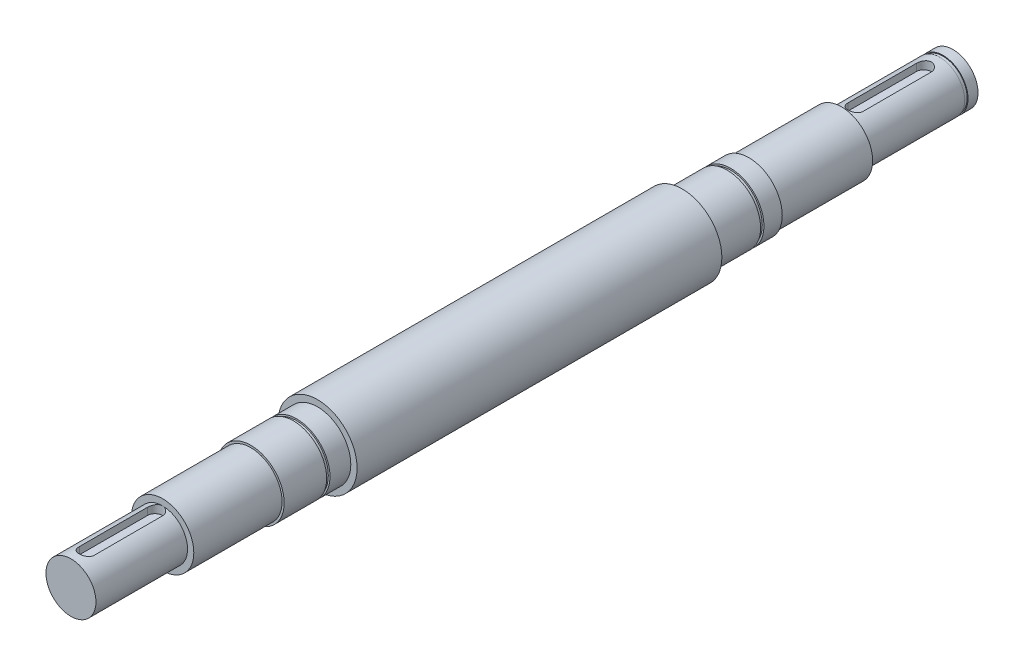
ISO-10303-21;
HEADER;
FILE_DESCRIPTION(('STEP AP214'),'2;1');
FILE_NAME('part.step','',(''),(''),'','','');
FILE_SCHEMA(('AUTOMOTIVE_DESIGN { 1 0 10303 214 1 1 1 1 }'));
ENDSEC;
DATA;
#1=APPLICATION_CONTEXT('core data for automotive mechanical design processes');
#2=APPLICATION_PROTOCOL_DEFINITION('international standard','automotive_design',2000,#1);
#3=PRODUCT_CONTEXT('',#1,'mechanical');
#4=PRODUCT('Part','Part','',(#3));
#5=PRODUCT_RELATED_PRODUCT_CATEGORY('part','',(#4));
#6=PRODUCT_DEFINITION_FORMATION('','',#4);
#7=PRODUCT_DEFINITION_CONTEXT('part definition',#1,'design');
#8=PRODUCT_DEFINITION('design','',#6,#7);
#9=PRODUCT_DEFINITION_SHAPE('','',#8);
#10=(LENGTH_UNIT() NAMED_UNIT(*) SI_UNIT(.MILLI.,.METRE.));
#11=(NAMED_UNIT(*) PLANE_ANGLE_UNIT() SI_UNIT($,.RADIAN.));
#12=(NAMED_UNIT(*) SI_UNIT($,.STERADIAN.) SOLID_ANGLE_UNIT());
#13=UNCERTAINTY_MEASURE_WITH_UNIT(LENGTH_MEASURE(1.E-05),#10,'distance_accuracy_value','');
#14=(GEOMETRIC_REPRESENTATION_CONTEXT(3) GLOBAL_UNCERTAINTY_ASSIGNED_CONTEXT((#13)) GLOBAL_UNIT_ASSIGNED_CONTEXT((#10,
#11,#12)) REPRESENTATION_CONTEXT('',''));
#15=CARTESIAN_POINT('',(0.,0.,0.));
#16=DIRECTION('',(0.,0.,1.));
#17=DIRECTION('',(1.,0.,0.));
#18=AXIS2_PLACEMENT_3D('',#15,#16,#17);
#19=CARTESIAN_POINT('',(0.,0.,529.5));
#20=DIRECTION('',(0.,0.,1.));
#21=DIRECTION('',(1.,0.,0.));
#22=AXIS2_PLACEMENT_3D('',#19,#20,#21);
#23=CYLINDRICAL_SURFACE('',#22,40.);
#24=CARTESIAN_POINT('',(0.,0.,233.5));
#25=DIRECTION('',(0.,0.,1.));
#26=DIRECTION('',(1.,0.,0.));
#27=AXIS2_PLACEMENT_3D('',#24,#25,#26);
#28=CIRCLE('',#27,40.);
#29=CARTESIAN_POINT('',(40.,0.,233.5));
#30=VERTEX_POINT('',#29);
#31=EDGE_CURVE('E345',#30,#30,#28,.T.);
#32=ORIENTED_EDGE('',*,*,#31,.T.);
#33=EDGE_LOOP('',(#32));
#34=FACE_BOUND('',#33,.T.);
#35=CARTESIAN_POINT('',(0.,0.,258.5));
#36=DIRECTION('',(0.,0.,1.));
#37=DIRECTION('',(1.,0.,0.));
#38=AXIS2_PLACEMENT_3D('',#35,#36,#37);
#39=CIRCLE('',#38,40.);
#40=CARTESIAN_POINT('',(40.,0.,258.5));
#41=VERTEX_POINT('',#40);
#42=EDGE_CURVE('E288',#41,#41,#39,.T.);
#43=ORIENTED_EDGE('',*,*,#42,.F.);
#44=EDGE_LOOP('',(#43));
#45=FACE_BOUND('',#44,.T.);
#46=ADVANCED_FACE('F34',(#34,#45),#23,.T.);
#47=CARTESIAN_POINT('',(0.,0.,529.5));
#48=DIRECTION('',(0.,0.,1.));
#49=DIRECTION('',(1.,0.,0.));
#50=AXIS2_PLACEMENT_3D('',#47,#48,#49);
#51=CYLINDRICAL_SURFACE('',#50,40.);
#52=CARTESIAN_POINT('',(0.,0.,-258.5));
#53=DIRECTION('',(0.,0.,1.));
#54=DIRECTION('',(1.,0.,0.));
#55=AXIS2_PLACEMENT_3D('',#52,#53,#54);
#56=CIRCLE('',#55,40.);
#57=CARTESIAN_POINT('',(40.,0.,-258.5));
#58=VERTEX_POINT('',#57);
#59=EDGE_CURVE('E309',#58,#58,#56,.T.);
#60=ORIENTED_EDGE('',*,*,#59,.T.);
#61=EDGE_LOOP('',(#60));
#62=FACE_BOUND('',#61,.T.);
#63=CARTESIAN_POINT('',(0.,0.,-208.5));
#64=DIRECTION('',(0.,0.,1.));
#65=DIRECTION('',(1.,0.,0.));
#66=AXIS2_PLACEMENT_3D('',#63,#64,#65);
#67=CIRCLE('',#66,40.);
#68=CARTESIAN_POINT('',(40.,0.,-208.5));
#69=VERTEX_POINT('',#68);
#70=EDGE_CURVE('E300',#69,#69,#67,.T.);
#71=ORIENTED_EDGE('',*,*,#70,.F.);
#72=EDGE_LOOP('',(#71));
#73=FACE_BOUND('',#72,.T.);
#74=ADVANCED_FACE('F231',(#62,#73),#51,.T.);
#75=CARTESIAN_POINT('',(0.,40.,-258.5));
#76=DIRECTION('',(0.,0.,-1.));
#77=DIRECTION('',(-1.,0.,0.));
#78=AXIS2_PLACEMENT_3D('',#75,#76,#77);
#79=PLANE('',#78);
#80=CARTESIAN_POINT('',(0.,0.,-258.5));
#81=DIRECTION('',(0.,0.,1.));
#82=DIRECTION('',(1.,0.,0.));
#83=AXIS2_PLACEMENT_3D('',#80,#81,#82);
#84=CIRCLE('',#83,38.);
#85=CARTESIAN_POINT('',(38.,0.,-258.5));
#86=VERTEX_POINT('',#85);
#87=EDGE_CURVE('E318',#86,#86,#84,.T.);
#88=ORIENTED_EDGE('',*,*,#87,.T.);
#89=EDGE_LOOP('',(#88));
#90=FACE_BOUND('',#89,.T.);
#91=ORIENTED_EDGE('',*,*,#59,.F.);
#92=EDGE_LOOP('',(#91));
#93=FACE_BOUND('',#92,.T.);
#94=ADVANCED_FACE('F227',(#90,#93),#79,.T.);
#95=CARTESIAN_POINT('',(0.,0.,0.));
#96=DIRECTION('',(0.,0.,1.));
#97=DIRECTION('',(1.,0.,0.));
#98=AXIS2_PLACEMENT_3D('',#95,#96,#97);
#99=CYLINDRICAL_SURFACE('',#98,38.);
#100=CARTESIAN_POINT('',(0.,0.,-262.5));
#101=DIRECTION('',(0.,0.,1.));
#102=DIRECTION('',(1.,0.,0.));
#103=AXIS2_PLACEMENT_3D('',#100,#101,#102);
#104=CIRCLE('',#103,38.);
#105=CARTESIAN_POINT('',(38.,0.,-262.5));
#106=VERTEX_POINT('',#105);
#107=EDGE_CURVE('E315',#106,#106,#104,.T.);
#108=ORIENTED_EDGE('',*,*,#107,.T.);
#109=EDGE_LOOP('',(#108));
#110=FACE_BOUND('',#109,.T.);
#111=ORIENTED_EDGE('',*,*,#87,.F.);
#112=EDGE_LOOP('',(#111));
#113=FACE_BOUND('',#112,.T.);
#114=ADVANCED_FACE('F223',(#110,#113),#99,.T.);
#115=CARTESIAN_POINT('',(0.,40.,-262.5));
#116=DIRECTION('',(0.,0.,1.));
#117=DIRECTION('',(1.,0.,0.));
#118=AXIS2_PLACEMENT_3D('',#115,#116,#117);
#119=PLANE('',#118);
#120=CARTESIAN_POINT('',(0.,0.,-262.5));
#121=DIRECTION('',(0.,0.,1.));
#122=DIRECTION('',(1.,0.,0.));
#123=AXIS2_PLACEMENT_3D('',#120,#121,#122);
#124=CIRCLE('',#123,40.);
#125=CARTESIAN_POINT('',(40.,0.,-262.5));
#126=VERTEX_POINT('',#125);
#127=EDGE_CURVE('E312',#126,#126,#124,.T.);
#128=ORIENTED_EDGE('',*,*,#127,.T.);
#129=EDGE_LOOP('',(#128));
#130=FACE_BOUND('',#129,.T.);
#131=ORIENTED_EDGE('',*,*,#107,.F.);
#132=EDGE_LOOP('',(#131));
#133=FACE_BOUND('',#132,.T.);
#134=ADVANCED_FACE('F220',(#130,#133),#119,.T.);
#135=CARTESIAN_POINT('',(0.,0.,-529.5));
#136=DIRECTION('',(0.,0.,1.));
#137=DIRECTION('',(1.,0.,0.));
#138=AXIS2_PLACEMENT_3D('',#135,#136,#137);
#139=PLANE('',#138);
#140=CARTESIAN_POINT('',(0.,0.,-529.5));
#141=DIRECTION('',(0.,0.,1.));
#142=DIRECTION('',(1.,0.,0.));
#143=AXIS2_PLACEMENT_3D('',#140,#141,#142);
#144=CIRCLE('',#143,30.);
#145=CARTESIAN_POINT('',(30.,0.,-529.5));
#146=VERTEX_POINT('',#145);
#147=EDGE_CURVE('E365',#146,#146,#144,.T.);
#148=ORIENTED_EDGE('',*,*,#147,.F.);
#149=EDGE_LOOP('',(#148));
#150=FACE_BOUND('',#149,.T.);
#151=ADVANCED_FACE('F36',(#150),#139,.F.);
#152=CARTESIAN_POINT('',(0.,0.,529.5));
#153=DIRECTION('',(0.,0.,1.));
#154=DIRECTION('',(1.,0.,0.));
#155=AXIS2_PLACEMENT_3D('',#152,#153,#154);
#156=CYLINDRICAL_SURFACE('',#155,30.);
#157=ORIENTED_EDGE('',*,*,#147,.T.);
#158=EDGE_LOOP('',(#157));
#159=FACE_BOUND('',#158,.T.);
#160=CARTESIAN_POINT('',(0.,0.,-517.5));
#161=DIRECTION('',(0.,0.,1.));
#162=DIRECTION('',(1.,0.,0.));
#163=AXIS2_PLACEMENT_3D('',#160,#161,#162);
#164=CIRCLE('',#163,30.);
#165=CARTESIAN_POINT('',(30.,0.,-517.5));
#166=VERTEX_POINT('',#165);
#167=EDGE_CURVE('E324',#166,#166,#164,.T.);
#168=ORIENTED_EDGE('',*,*,#167,.F.);
#169=EDGE_LOOP('',(#168));
#170=FACE_BOUND('',#169,.T.);
#171=ADVANCED_FACE('F237',(#159,#170),#156,.T.);
#172=CARTESIAN_POINT('',(0.,30.,-517.5));
#173=DIRECTION('',(0.,0.,1.));
#174=DIRECTION('',(1.,0.,0.));
#175=AXIS2_PLACEMENT_3D('',#172,#173,#174);
#176=PLANE('',#175);
#177=ORIENTED_EDGE('',*,*,#167,.T.);
#178=EDGE_LOOP('',(#177));
#179=FACE_BOUND('',#178,.T.);
#180=CARTESIAN_POINT('',(0.,0.,-517.5));
#181=DIRECTION('',(0.,0.,1.));
#182=DIRECTION('',(1.,0.,0.));
#183=AXIS2_PLACEMENT_3D('',#180,#181,#182);
#184=CIRCLE('',#183,29.);
#185=CARTESIAN_POINT('',(29.,0.,-517.5));
#186=VERTEX_POINT('',#185);
#187=EDGE_CURVE('E327',#186,#186,#184,.T.);
#188=ORIENTED_EDGE('',*,*,#187,.F.);
#189=EDGE_LOOP('',(#188));
#190=FACE_BOUND('',#189,.T.);
#191=ADVANCED_FACE('F233',(#179,#190),#176,.T.);
#192=CARTESIAN_POINT('',(0.,0.,0.));
#193=DIRECTION('',(0.,0.,1.));
#194=DIRECTION('',(1.,0.,0.));
#195=AXIS2_PLACEMENT_3D('',#192,#193,#194);
#196=CYLINDRICAL_SURFACE('',#195,29.);
#197=ORIENTED_EDGE('',*,*,#187,.T.);
#198=EDGE_LOOP('',(#197));
#199=FACE_BOUND('',#198,.T.);
#200=CARTESIAN_POINT('',(0.,0.,-513.5));
#201=DIRECTION('',(0.,0.,1.));
#202=DIRECTION('',(1.,0.,0.));
#203=AXIS2_PLACEMENT_3D('',#200,#201,#202);
#204=CIRCLE('',#203,29.);
#205=CARTESIAN_POINT('',(29.,0.,-513.5));
#206=VERTEX_POINT('',#205);
#207=EDGE_CURVE('E330',#206,#206,#204,.T.);
#208=ORIENTED_EDGE('',*,*,#207,.F.);
#209=EDGE_LOOP('',(#208));
#210=FACE_BOUND('',#209,.T.);
#211=ADVANCED_FACE('F236',(#199,#210),#196,.T.);
#212=CARTESIAN_POINT('',(0.,30.,-513.5));
#213=DIRECTION('',(0.,0.,-1.));
#214=DIRECTION('',(-1.,0.,0.));
#215=AXIS2_PLACEMENT_3D('',#212,#213,#214);
#216=PLANE('',#215);
#217=ORIENTED_EDGE('',*,*,#207,.T.);
#218=EDGE_LOOP('',(#217));
#219=FACE_BOUND('',#218,.T.);
#220=CARTESIAN_POINT('',(0.,0.,-513.5));
#221=DIRECTION('',(0.,0.,1.));
#222=DIRECTION('',(1.,0.,0.));
#223=AXIS2_PLACEMENT_3D('',#220,#221,#222);
#224=CIRCLE('',#223,30.);
#225=CARTESIAN_POINT('',(30.,0.,-513.5));
#226=VERTEX_POINT('',#225);
#227=EDGE_CURVE('E321',#226,#226,#224,.T.);
#228=ORIENTED_EDGE('',*,*,#227,.F.);
#229=EDGE_LOOP('',(#228));
#230=FACE_BOUND('',#229,.T.);
#231=ADVANCED_FACE('F241',(#219,#230),#216,.T.);
#232=DIRECTION('',(0.,0.,1.));
#233=VECTOR('',#232,1.);
#234=CARTESIAN_POINT('',(-9.,28.6181760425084,529.5));
#235=LINE('',#234,#233);
#236=CARTESIAN_POINT('',(-9.,28.6181760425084,-412.5));
#237=VERTEX_POINT('',#236);
#238=CARTESIAN_POINT('',(-9.,28.6181760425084,-494.5));
#239=VERTEX_POINT('',#238);
#240=EDGE_CURVE('E11',#237,#239,#235,.F.);
#241=ORIENTED_EDGE('',*,*,#240,.T.);
#242=CARTESIAN_POINT('',(-9.,28.6181760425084,-494.5));
#243=CARTESIAN_POINT('',(-9.00003345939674,28.6181405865,-494.747001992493));
#244=CARTESIAN_POINT('',(-8.98983319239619,28.621372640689,-494.99399108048));
#245=CARTESIAN_POINT('',(-8.94921297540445,28.6341128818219,-495.486084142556));
#246=CARTESIAN_POINT('',(-8.91879757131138,28.6436196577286,-495.731188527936));
#247=CARTESIAN_POINT('',(-8.83809683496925,28.6686190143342,-496.217150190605));
#248=CARTESIAN_POINT('',(-8.78786195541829,28.6840963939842,-496.458016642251));
#249=CARTESIAN_POINT('',(-8.66797644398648,28.7205524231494,-496.934443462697));
#250=CARTESIAN_POINT('',(-8.598325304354,28.7415312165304,-497.17000369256));
#251=CARTESIAN_POINT('',(-8.44023925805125,28.7883507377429,-497.63407398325));
#252=CARTESIAN_POINT('',(-8.3518154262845,28.8141885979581,-497.862588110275));
#253=CARTESIAN_POINT('',(-8.15682366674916,28.8699932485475,-498.311311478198));
#254=CARTESIAN_POINT('',(-8.05024901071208,28.8999615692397,-498.531517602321));
#255=CARTESIAN_POINT('',(-7.81973996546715,28.9631825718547,-498.962212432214));
#256=CARTESIAN_POINT('',(-7.69580177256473,28.9964359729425,-499.172698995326));
#257=CARTESIAN_POINT('',(-7.43143303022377,29.0653136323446,-499.582646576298));
#258=CARTESIAN_POINT('',(-7.2910015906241,29.1009380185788,-499.78210699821));
#259=CARTESIAN_POINT('',(-6.99033485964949,29.1746438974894,-500.174328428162));
#260=CARTESIAN_POINT('',(-6.82964940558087,29.2127664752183,-500.366736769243));
#261=CARTESIAN_POINT('',(-6.49284654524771,29.2894651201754,-500.73744026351));
#262=CARTESIAN_POINT('',(-6.31672889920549,29.3280411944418,-500.915735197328));
#263=CARTESIAN_POINT('',(-5.9501389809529,29.4046069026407,-501.257113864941));
#264=CARTESIAN_POINT('',(-5.75966408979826,29.4425964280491,-501.420194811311));
#265=CARTESIAN_POINT('',(-5.36558117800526,29.5169568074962,-501.730031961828));
#266=CARTESIAN_POINT('',(-5.16197353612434,29.5533277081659,-501.876788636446));
#267=CARTESIAN_POINT('',(-4.73849718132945,29.6242077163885,-502.155866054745));
#268=CARTESIAN_POINT('',(-4.51837706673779,29.658661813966,-502.287819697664));
#269=CARTESIAN_POINT('',(-4.06733115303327,29.7238744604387,-502.532597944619));
#270=CARTESIAN_POINT('',(-3.83640960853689,29.7546344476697,-502.645430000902));
#271=CARTESIAN_POINT('',(-3.36528194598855,29.8115945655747,-502.85110414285));
#272=CARTESIAN_POINT('',(-3.12507587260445,29.8377947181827,-502.943946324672));
#273=CARTESIAN_POINT('',(-2.63712035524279,29.8848734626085,-503.108827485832));
#274=CARTESIAN_POINT('',(-2.38937116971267,29.9057522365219,-503.180867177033));
#275=CARTESIAN_POINT('',(-1.89536420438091,29.941061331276,-503.301726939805));
#276=CARTESIAN_POINT('',(-1.6492663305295,29.9556589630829,-503.35115203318));
#277=CARTESIAN_POINT('',(-1.15352379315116,29.9788416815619,-503.429296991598));
#278=CARTESIAN_POINT('',(-0.903879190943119,29.9874268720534,-503.458017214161));
#279=CARTESIAN_POINT('',(-0.402966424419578,29.9983393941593,-503.494479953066));
#280=CARTESIAN_POINT('',(-0.151698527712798,30.0006677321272,-503.502225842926));
#281=CARTESIAN_POINT('',(0.350581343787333,29.999002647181,-503.496675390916));
#282=CARTESIAN_POINT('',(0.60159332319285,29.995009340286,-503.48337943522));
#283=CARTESIAN_POINT('',(1.09342288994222,29.981044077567,-503.436636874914));
#284=CARTESIAN_POINT('',(1.33430914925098,29.9712680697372,-503.403850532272));
#285=CARTESIAN_POINT('',(1.81244634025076,29.9461578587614,-503.318957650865));
#286=CARTESIAN_POINT('',(2.04969594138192,29.9308216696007,-503.266844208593));
#287=CARTESIAN_POINT('',(2.51880063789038,29.8949991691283,-503.143751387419));
#288=CARTESIAN_POINT('',(2.75065669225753,29.8745137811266,-503.072775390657));
#289=CARTESIAN_POINT('',(3.20749457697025,29.828923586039,-502.912525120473));
#290=CARTESIAN_POINT('',(3.43247608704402,29.8038185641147,-502.823249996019));
#291=CARTESIAN_POINT('',(3.87668806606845,29.7493184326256,-502.625948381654));
#292=CARTESIAN_POINT('',(4.09582147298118,29.719876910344,-502.517716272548));
#293=CARTESIAN_POINT('',(4.52421097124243,29.6576865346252,-502.284025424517));
#294=CARTESIAN_POINT('',(4.73346680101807,29.6249375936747,-502.158566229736));
#295=CARTESIAN_POINT('',(5.14083485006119,29.5569698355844,-501.8912898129));
#296=CARTESIAN_POINT('',(5.33894686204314,29.5217509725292,-501.749472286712));
#297=CARTESIAN_POINT('',(5.7229142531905,29.4497271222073,-501.450359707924));
#298=CARTESIAN_POINT('',(5.90876553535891,29.4129216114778,-501.293059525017));
#299=CARTESIAN_POINT('',(6.2739239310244,29.3372454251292,-500.957682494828));
#300=CARTESIAN_POINT('',(6.45270703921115,29.2983496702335,-500.779040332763));
#301=CARTESIAN_POINT('',(6.79466140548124,29.2209397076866,-500.407313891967));
#302=CARTESIAN_POINT('',(6.95783250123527,29.1824255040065,-500.214229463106));
#303=CARTESIAN_POINT('',(7.26756046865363,29.1068376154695,-499.814741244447));
#304=CARTESIAN_POINT('',(7.41410915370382,29.069764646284,-499.608330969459));
#305=CARTESIAN_POINT('',(7.68942708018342,28.9981541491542,-499.183665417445));
#306=CARTESIAN_POINT('',(7.81820290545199,28.9636156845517,-498.965414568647));
#307=CARTESIAN_POINT('',(8.05834620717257,28.8977288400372,-498.51604729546));
#308=CARTESIAN_POINT('',(8.16951557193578,28.8664179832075,-498.28481938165));
#309=CARTESIAN_POINT('',(8.37184037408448,28.8083905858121,-497.813317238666));
#310=CARTESIAN_POINT('',(8.4630039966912,28.7816721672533,-497.573046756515));
#311=CARTESIAN_POINT('',(8.62449218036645,28.7336951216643,-497.085351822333));
#312=CARTESIAN_POINT('',(8.69483869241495,28.7124307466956,-496.837935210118));
#313=CARTESIAN_POINT('',(8.81414193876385,28.6760314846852,-496.337660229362));
#314=CARTESIAN_POINT('',(8.86310853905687,28.6608937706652,-496.084804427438));
#315=CARTESIAN_POINT('',(8.93404697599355,28.6388555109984,-495.610094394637));
#316=CARTESIAN_POINT('',(8.95877956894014,28.6311161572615,-495.388687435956));
#317=CARTESIAN_POINT('',(8.99175392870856,28.6207689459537,-494.944859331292));
#318=CARTESIAN_POINT('',(9.00001994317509,28.6181535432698,-494.722440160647));
#319=CARTESIAN_POINT('',(9.,28.6181760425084,-494.5));
#320=B_SPLINE_CURVE_WITH_KNOTS('',3,(#242,#243,#244,#245,#246,#247,#248,#249,#250,#251,#252,
#253,#254,#255,#256,#257,#258,#259,#260,#261,#262,#263,#264,#265,#266,#267,#268,#269,#270,#271,
#272,#273,#274,#275,#276,#277,#278,#279,#280,#281,#282,#283,#284,#285,#286,#287,#288,#289,#290,
#291,#292,#293,#294,#295,#296,#297,#298,#299,#300,#301,#302,#303,#304,#305,#306,#307,#308,#309,
#310,#311,#312,#313,#314,#315,#316,#317,#318,#319),.UNSPECIFIED.,.F.,.F.,(4,2,2,2,2,2,2,2,2,2,2,
2,2,2,2,2,2,2,2,2,2,2,2,2,2,2,2,2,2,2,2,2,2,2,2,2,2,2,4),(0.,0.740754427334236,1.48134233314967,
2.22005702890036,2.95879104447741,3.69709045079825,4.43566413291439,5.174399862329,
5.91317548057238,6.67299483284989,7.43282599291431,8.19279609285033,8.95274428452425,
9.72862284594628,10.5041983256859,11.2797700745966,12.0553152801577,12.8086853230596,
13.5620423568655,14.3152782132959,15.0685002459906,15.7975536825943,16.5268677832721,
17.2560512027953,17.9852685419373,18.7229498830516,19.4606507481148,20.198365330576,
20.9363251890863,21.7025751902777,22.4688331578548,23.2354668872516,24.0018158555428,
24.7762543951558,25.5503754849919,26.3236773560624,27.0966220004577,27.7647196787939,
28.4318328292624),.UNSPECIFIED.);
#321=CARTESIAN_POINT('',(9.,28.6181760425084,-494.5));
#322=VERTEX_POINT('',#321);
#323=EDGE_CURVE('E393',#239,#322,#320,.T.);
#324=ORIENTED_EDGE('',*,*,#323,.T.);
#325=DIRECTION('',(0.,0.,1.));
#326=VECTOR('',#325,1.);
#327=CARTESIAN_POINT('',(9.,28.6181760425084,529.5));
#328=LINE('',#327,#326);
#329=CARTESIAN_POINT('',(9.,28.6181760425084,-412.5));
#330=VERTEX_POINT('',#329);
#331=EDGE_CURVE('E42',#322,#330,#328,.T.);
#332=ORIENTED_EDGE('',*,*,#331,.T.);
#333=CARTESIAN_POINT('',(9.,28.6181760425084,-412.5));
#334=CARTESIAN_POINT('',(9.00003345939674,28.6181405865,-412.252998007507));
#335=CARTESIAN_POINT('',(8.98983319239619,28.621372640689,-412.00600891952));
#336=CARTESIAN_POINT('',(8.94921297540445,28.6341128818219,-411.513915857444));
#337=CARTESIAN_POINT('',(8.91879757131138,28.6436196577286,-411.268811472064));
#338=CARTESIAN_POINT('',(8.83809683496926,28.6686190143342,-410.782849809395));
#339=CARTESIAN_POINT('',(8.78786195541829,28.6840963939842,-410.541983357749));
#340=CARTESIAN_POINT('',(8.66797644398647,28.7205524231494,-410.065556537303));
#341=CARTESIAN_POINT('',(8.598325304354,28.7415312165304,-409.82999630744));
#342=CARTESIAN_POINT('',(8.44023925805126,28.7883507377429,-409.36592601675));
#343=CARTESIAN_POINT('',(8.35181542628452,28.8141885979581,-409.137411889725));
#344=CARTESIAN_POINT('',(8.15682366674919,28.8699932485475,-408.688688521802));
#345=CARTESIAN_POINT('',(8.05024901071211,28.8999615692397,-408.468482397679));
#346=CARTESIAN_POINT('',(7.81973996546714,28.9631825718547,-408.037787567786));
#347=CARTESIAN_POINT('',(7.6958017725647,28.9964359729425,-407.827301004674));
#348=CARTESIAN_POINT('',(7.43143303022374,29.0653136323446,-407.417353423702));
#349=CARTESIAN_POINT('',(7.29100159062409,29.1009380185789,-407.21789300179));
#350=CARTESIAN_POINT('',(6.99033485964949,29.1746438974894,-406.825671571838));
#351=CARTESIAN_POINT('',(6.82964940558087,29.2127664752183,-406.633263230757));
#352=CARTESIAN_POINT('',(6.49284654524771,29.2894651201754,-406.26255973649));
#353=CARTESIAN_POINT('',(6.31672889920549,29.3280411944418,-406.084264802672));
#354=CARTESIAN_POINT('',(5.95013898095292,29.4046069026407,-405.742886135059));
#355=CARTESIAN_POINT('',(5.75966408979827,29.4425964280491,-405.579805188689));
#356=CARTESIAN_POINT('',(5.36558117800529,29.5169568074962,-405.269968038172));
#357=CARTESIAN_POINT('',(5.16197353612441,29.5533277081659,-405.123211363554));
#358=CARTESIAN_POINT('',(4.73849718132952,29.6242077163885,-404.844133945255));
#359=CARTESIAN_POINT('',(4.51837706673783,29.658661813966,-404.712180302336));
#360=CARTESIAN_POINT('',(4.06733115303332,29.7238744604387,-404.467402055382));
#361=CARTESIAN_POINT('',(3.83640960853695,29.7546344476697,-404.354569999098));
#362=CARTESIAN_POINT('',(3.36528194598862,29.8115945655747,-404.14889585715));
#363=CARTESIAN_POINT('',(3.12507587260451,29.8377947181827,-404.056053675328));
#364=CARTESIAN_POINT('',(2.63712035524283,29.8848734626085,-403.891172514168));
#365=CARTESIAN_POINT('',(2.38937116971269,29.9057522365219,-403.819132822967));
#366=CARTESIAN_POINT('',(1.8953642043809,29.941061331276,-403.698273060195));
#367=CARTESIAN_POINT('',(1.64926633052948,29.9556589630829,-403.64884796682));
#368=CARTESIAN_POINT('',(1.15352379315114,29.9788416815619,-403.570703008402));
#369=CARTESIAN_POINT('',(0.903879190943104,29.9874268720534,-403.541982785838));
#370=CARTESIAN_POINT('',(0.402966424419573,29.9983393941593,-403.505520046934));
#371=CARTESIAN_POINT('',(0.151698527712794,30.0006677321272,-403.497774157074));
#372=CARTESIAN_POINT('',(-0.350581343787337,29.999002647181,-403.503324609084));
#373=CARTESIAN_POINT('',(-0.601593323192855,29.995009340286,-403.51662056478));
#374=CARTESIAN_POINT('',(-1.09342288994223,29.981044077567,-403.563363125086));
#375=CARTESIAN_POINT('',(-1.33430914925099,29.9712680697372,-403.596149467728));
#376=CARTESIAN_POINT('',(-1.81244634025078,29.9461578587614,-403.681042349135));
#377=CARTESIAN_POINT('',(-2.04969594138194,29.9308216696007,-403.733155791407));
#378=CARTESIAN_POINT('',(-2.51880063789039,29.8949991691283,-403.856248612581));
#379=CARTESIAN_POINT('',(-2.75065669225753,29.8745137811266,-403.927224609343));
#380=CARTESIAN_POINT('',(-3.20749457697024,29.828923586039,-404.087474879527));
#381=CARTESIAN_POINT('',(-3.43247608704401,29.8038185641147,-404.176750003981));
#382=CARTESIAN_POINT('',(-3.87668806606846,29.7493184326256,-404.374051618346));
#383=CARTESIAN_POINT('',(-4.0958214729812,29.719876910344,-404.482283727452));
#384=CARTESIAN_POINT('',(-4.52421097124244,29.6576865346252,-404.715974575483));
#385=CARTESIAN_POINT('',(-4.73346680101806,29.6249375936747,-404.841433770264));
#386=CARTESIAN_POINT('',(-5.14083485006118,29.5569698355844,-405.1087101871));
#387=CARTESIAN_POINT('',(-5.33894686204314,29.5217509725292,-405.250527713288));
#388=CARTESIAN_POINT('',(-5.7229142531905,29.4497271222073,-405.549640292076));
#389=CARTESIAN_POINT('',(-5.90876553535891,29.4129216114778,-405.706940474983));
#390=CARTESIAN_POINT('',(-6.27392393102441,29.3372454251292,-406.042317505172));
#391=CARTESIAN_POINT('',(-6.45270703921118,29.2983496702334,-406.220959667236));
#392=CARTESIAN_POINT('',(-6.79466140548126,29.2209397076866,-406.592686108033));
#393=CARTESIAN_POINT('',(-6.95783250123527,29.1824255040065,-406.785770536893));
#394=CARTESIAN_POINT('',(-7.2675604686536,29.1068376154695,-407.185258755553));
#395=CARTESIAN_POINT('',(-7.41410915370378,29.069764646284,-407.391669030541));
#396=CARTESIAN_POINT('',(-7.68942708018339,28.9981541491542,-407.816334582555));
#397=CARTESIAN_POINT('',(-7.81820290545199,28.9636156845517,-408.034585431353));
#398=CARTESIAN_POINT('',(-8.05834620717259,28.8977288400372,-408.48395270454));
#399=CARTESIAN_POINT('',(-8.1695155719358,28.8664179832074,-408.71518061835));
#400=CARTESIAN_POINT('',(-8.3718403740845,28.8083905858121,-409.186682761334));
#401=CARTESIAN_POINT('',(-8.46300399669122,28.7816721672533,-409.426953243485));
#402=CARTESIAN_POINT('',(-8.62449218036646,28.7336951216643,-409.914648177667));
#403=CARTESIAN_POINT('',(-8.69483869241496,28.7124307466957,-410.162064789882));
#404=CARTESIAN_POINT('',(-8.81414193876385,28.6760314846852,-410.662339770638));
#405=CARTESIAN_POINT('',(-8.86310853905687,28.6608937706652,-410.915195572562));
#406=CARTESIAN_POINT('',(-8.93404697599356,28.6388555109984,-411.389905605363));
#407=CARTESIAN_POINT('',(-8.95877956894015,28.6311161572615,-411.611312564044));
#408=CARTESIAN_POINT('',(-8.99175392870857,28.6207689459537,-412.055140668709));
#409=CARTESIAN_POINT('',(-9.00001994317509,28.6181535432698,-412.277559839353));
#410=CARTESIAN_POINT('',(-9.,28.6181760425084,-412.5));
#411=B_SPLINE_CURVE_WITH_KNOTS('',3,(#333,#334,#335,#336,#337,#338,#339,#340,#341,#342,#343,
#344,#345,#346,#347,#348,#349,#350,#351,#352,#353,#354,#355,#356,#357,#358,#359,#360,#361,#362,
#363,#364,#365,#366,#367,#368,#369,#370,#371,#372,#373,#374,#375,#376,#377,#378,#379,#380,#381,
#382,#383,#384,#385,#386,#387,#388,#389,#390,#391,#392,#393,#394,#395,#396,#397,#398,#399,#400,
#401,#402,#403,#404,#405,#406,#407,#408,#409,#410),.UNSPECIFIED.,.F.,.F.,(4,2,2,2,2,2,2,2,2,2,2,
2,2,2,2,2,2,2,2,2,2,2,2,2,2,2,2,2,2,2,2,2,2,2,2,2,2,2,4),(0.,0.740754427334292,1.48134233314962,
2.22005702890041,2.95879104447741,3.69709045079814,4.43566413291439,5.17439986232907,
5.91317548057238,6.67299483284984,7.43282599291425,8.19279609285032,8.95274428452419,
9.72862284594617,10.5041983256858,11.2797700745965,12.0553152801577,12.8086853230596,
13.5620423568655,14.3152782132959,15.0685002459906,15.7975536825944,16.5268677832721,
17.2560512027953,17.9852685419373,18.7229498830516,19.4606507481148,20.198365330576,
20.9363251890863,21.7025751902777,22.4688331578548,23.2354668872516,24.0018158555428,
24.7762543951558,25.5503754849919,26.3236773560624,27.0966220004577,27.764719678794,
28.4318328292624),.UNSPECIFIED.);
#412=EDGE_CURVE('E49',#330,#237,#411,.T.);
#413=ORIENTED_EDGE('',*,*,#412,.T.);
#414=EDGE_LOOP('',(#241,#324,#332,#413));
#415=FACE_BOUND('',#414,.T.);
#416=CARTESIAN_POINT('',(0.,0.,-395.5));
#417=DIRECTION('',(0.,0.,1.));
#418=DIRECTION('',(1.,0.,0.));
#419=AXIS2_PLACEMENT_3D('',#416,#417,#418);
#420=CIRCLE('',#419,30.);
#421=CARTESIAN_POINT('',(30.,0.,-395.5));
#422=VERTEX_POINT('',#421);
#423=EDGE_CURVE('E362',#422,#422,#420,.T.);
#424=ORIENTED_EDGE('',*,*,#423,.F.);
#425=EDGE_LOOP('',(#424));
#426=FACE_BOUND('',#425,.T.);
#427=ORIENTED_EDGE('',*,*,#227,.T.);
#428=EDGE_LOOP('',(#427));
#429=FACE_BOUND('',#428,.T.);
#430=ADVANCED_FACE('F244',(#415,#426,#429),#156,.T.);
#431=CARTESIAN_POINT('',(0.,30.,-395.5));
#432=DIRECTION('',(0.,0.,1.));
#433=DIRECTION('',(1.,0.,0.));
#434=AXIS2_PLACEMENT_3D('',#431,#432,#433);
#435=PLANE('',#434);
#436=CARTESIAN_POINT('',(0.,0.,-395.5));
#437=DIRECTION('',(0.,0.,1.));
#438=DIRECTION('',(1.,0.,0.));
#439=AXIS2_PLACEMENT_3D('',#436,#437,#438);
#440=CIRCLE('',#439,37.5);
#441=CARTESIAN_POINT('',(37.5,0.,-395.5));
#442=VERTEX_POINT('',#441);
#443=EDGE_CURVE('E359',#442,#442,#440,.T.);
#444=ORIENTED_EDGE('',*,*,#443,.F.);
#445=EDGE_LOOP('',(#444));
#446=FACE_BOUND('',#445,.T.);
#447=ORIENTED_EDGE('',*,*,#423,.T.);
#448=EDGE_LOOP('',(#447));
#449=FACE_BOUND('',#448,.T.);
#450=ADVANCED_FACE('F400',(#446,#449),#435,.F.);
#451=CARTESIAN_POINT('',(0.,0.,529.5));
#452=DIRECTION('',(0.,0.,1.));
#453=DIRECTION('',(1.,0.,0.));
#454=AXIS2_PLACEMENT_3D('',#451,#452,#453);
#455=CYLINDRICAL_SURFACE('',#454,37.5);
#456=CARTESIAN_POINT('',(0.,0.,-284.5));
#457=DIRECTION('',(0.,0.,1.));
#458=DIRECTION('',(1.,0.,0.));
#459=AXIS2_PLACEMENT_3D('',#456,#457,#458);
#460=CIRCLE('',#459,37.5);
#461=CARTESIAN_POINT('',(37.5,0.,-284.5));
#462=VERTEX_POINT('',#461);
#463=EDGE_CURVE('E356',#462,#462,#460,.T.);
#464=ORIENTED_EDGE('',*,*,#463,.F.);
#465=EDGE_LOOP('',(#464));
#466=FACE_BOUND('',#465,.T.);
#467=ORIENTED_EDGE('',*,*,#443,.T.);
#468=EDGE_LOOP('',(#467));
#469=FACE_BOUND('',#468,.T.);
#470=ADVANCED_FACE('F405',(#466,#469),#455,.T.);
#471=CARTESIAN_POINT('',(0.,37.5,-284.5));
#472=DIRECTION('',(0.,0.,1.));
#473=DIRECTION('',(1.,0.,0.));
#474=AXIS2_PLACEMENT_3D('',#471,#472,#473);
#475=PLANE('',#474);
#476=CARTESIAN_POINT('',(0.,0.,-284.5));
#477=DIRECTION('',(0.,0.,1.));
#478=DIRECTION('',(1.,0.,0.));
#479=AXIS2_PLACEMENT_3D('',#476,#477,#478);
#480=CIRCLE('',#479,40.);
#481=CARTESIAN_POINT('',(40.,0.,-284.5));
#482=VERTEX_POINT('',#481);
#483=EDGE_CURVE('E353',#482,#482,#480,.T.);
#484=ORIENTED_EDGE('',*,*,#483,.F.);
#485=EDGE_LOOP('',(#484));
#486=FACE_BOUND('',#485,.T.);
#487=ORIENTED_EDGE('',*,*,#463,.T.);
#488=EDGE_LOOP('',(#487));
#489=FACE_BOUND('',#488,.T.);
#490=ADVANCED_FACE('F409',(#486,#489),#475,.F.);
#491=ORIENTED_EDGE('',*,*,#483,.T.);
#492=EDGE_LOOP('',(#491));
#493=FACE_BOUND('',#492,.T.);
#494=ORIENTED_EDGE('',*,*,#127,.F.);
#495=EDGE_LOOP('',(#494));
#496=FACE_BOUND('',#495,.T.);
#497=ADVANCED_FACE('F218',(#493,#496),#51,.T.);
#498=CARTESIAN_POINT('',(0.,0.,0.));
#499=DIRECTION('',(0.,0.,1.));
#500=DIRECTION('',(1.,0.,0.));
#501=AXIS2_PLACEMENT_3D('',#498,#499,#500);
#502=CYLINDRICAL_SURFACE('',#501,38.);
#503=CARTESIAN_POINT('',(0.,0.,-208.5));
#504=DIRECTION('',(0.,0.,1.));
#505=DIRECTION('',(1.,0.,0.));
#506=AXIS2_PLACEMENT_3D('',#503,#504,#505);
#507=CIRCLE('',#506,38.);
#508=CARTESIAN_POINT('',(38.,0.,-208.5));
#509=VERTEX_POINT('',#508);
#510=EDGE_CURVE('E303',#509,#509,#507,.T.);
#511=ORIENTED_EDGE('',*,*,#510,.T.);
#512=EDGE_LOOP('',(#511));
#513=FACE_BOUND('',#512,.T.);
#514=CARTESIAN_POINT('',(0.,0.,-204.5));
#515=DIRECTION('',(0.,0.,1.));
#516=DIRECTION('',(1.,0.,0.));
#517=AXIS2_PLACEMENT_3D('',#514,#515,#516);
#518=CIRCLE('',#517,38.);
#519=CARTESIAN_POINT('',(38.,0.,-204.5));
#520=VERTEX_POINT('',#519);
#521=EDGE_CURVE('E306',#520,#520,#518,.T.);
#522=ORIENTED_EDGE('',*,*,#521,.F.);
#523=EDGE_LOOP('',(#522));
#524=FACE_BOUND('',#523,.T.);
#525=ADVANCED_FACE('F214',(#513,#524),#502,.T.);
#526=CARTESIAN_POINT('',(0.,40.,-208.5));
#527=DIRECTION('',(0.,0.,1.));
#528=DIRECTION('',(1.,0.,0.));
#529=AXIS2_PLACEMENT_3D('',#526,#527,#528);
#530=PLANE('',#529);
#531=ORIENTED_EDGE('',*,*,#70,.T.);
#532=EDGE_LOOP('',(#531));
#533=FACE_BOUND('',#532,.T.);
#534=ORIENTED_EDGE('',*,*,#510,.F.);
#535=EDGE_LOOP('',(#534));
#536=FACE_BOUND('',#535,.T.);
#537=ADVANCED_FACE('F210',(#533,#536),#530,.T.);
#538=CARTESIAN_POINT('',(0.,47.5,233.5));
#539=DIRECTION('',(0.,0.,-1.));
#540=DIRECTION('',(-1.,0.,0.));
#541=AXIS2_PLACEMENT_3D('',#538,#539,#540);
#542=PLANE('',#541);
#543=ORIENTED_EDGE('',*,*,#31,.F.);
#544=EDGE_LOOP('',(#543));
#545=FACE_BOUND('',#544,.T.);
#546=CARTESIAN_POINT('',(0.,0.,233.5));
#547=DIRECTION('',(0.,0.,1.));
#548=DIRECTION('',(1.,0.,0.));
#549=AXIS2_PLACEMENT_3D('',#546,#547,#548);
#550=CIRCLE('',#549,47.5);
#551=CARTESIAN_POINT('',(47.5,0.,233.5));
#552=VERTEX_POINT('',#551);
#553=EDGE_CURVE('E347',#552,#552,#550,.T.);
#554=ORIENTED_EDGE('',*,*,#553,.T.);
#555=EDGE_LOOP('',(#554));
#556=FACE_BOUND('',#555,.T.);
#557=ADVANCED_FACE('F213',(#545,#556),#542,.F.);
#558=CARTESIAN_POINT('',(0.,0.,529.5));
#559=DIRECTION('',(0.,0.,1.));
#560=DIRECTION('',(1.,0.,0.));
#561=AXIS2_PLACEMENT_3D('',#558,#559,#560);
#562=CYLINDRICAL_SURFACE('',#561,47.5);
#563=ORIENTED_EDGE('',*,*,#553,.F.);
#564=EDGE_LOOP('',(#563));
#565=FACE_BOUND('',#564,.T.);
#566=CARTESIAN_POINT('',(0.,0.,-204.5));
#567=DIRECTION('',(0.,0.,1.));
#568=DIRECTION('',(1.,0.,0.));
#569=AXIS2_PLACEMENT_3D('',#566,#567,#568);
#570=CIRCLE('',#569,47.5);
#571=CARTESIAN_POINT('',(47.5,0.,-204.5));
#572=VERTEX_POINT('',#571);
#573=EDGE_CURVE('E350',#572,#572,#570,.T.);
#574=ORIENTED_EDGE('',*,*,#573,.T.);
#575=EDGE_LOOP('',(#574));
#576=FACE_BOUND('',#575,.T.);
#577=ADVANCED_FACE('F416',(#565,#576),#562,.T.);
#578=CARTESIAN_POINT('',(0.,40.,-204.5));
#579=DIRECTION('',(0.,0.,1.));
#580=DIRECTION('',(1.,0.,0.));
#581=AXIS2_PLACEMENT_3D('',#578,#579,#580);
#582=PLANE('',#581);
#583=ORIENTED_EDGE('',*,*,#573,.F.);
#584=EDGE_LOOP('',(#583));
#585=FACE_BOUND('',#584,.T.);
#586=ORIENTED_EDGE('',*,*,#521,.T.);
#587=EDGE_LOOP('',(#586));
#588=FACE_BOUND('',#587,.T.);
#589=ADVANCED_FACE('F208',(#585,#588),#582,.F.);
#590=CARTESIAN_POINT('',(0.,40.,258.5));
#591=DIRECTION('',(0.,0.,1.));
#592=DIRECTION('',(-1.,0.,0.));
#593=AXIS2_PLACEMENT_3D('',#590,#591,#592);
#594=PLANE('',#593);
#595=CARTESIAN_POINT('',(0.,0.,258.5));
#596=DIRECTION('',(0.,0.,1.));
#597=DIRECTION('',(1.,0.,0.));
#598=AXIS2_PLACEMENT_3D('',#595,#596,#597);
#599=CIRCLE('',#598,38.);
#600=CARTESIAN_POINT('',(38.,0.,258.5));
#601=VERTEX_POINT('',#600);
#602=EDGE_CURVE('E291',#601,#601,#599,.T.);
#603=ORIENTED_EDGE('',*,*,#602,.F.);
#604=EDGE_LOOP('',(#603));
#605=FACE_BOUND('',#604,.T.);
#606=ORIENTED_EDGE('',*,*,#42,.T.);
#607=EDGE_LOOP('',(#606));
#608=FACE_BOUND('',#607,.T.);
#609=ADVANCED_FACE('F204',(#605,#608),#594,.T.);
#610=CARTESIAN_POINT('',(0.,0.,0.));
#611=DIRECTION('',(0.,0.,-1.));
#612=DIRECTION('',(1.,0.,0.));
#613=AXIS2_PLACEMENT_3D('',#610,#611,#612);
#614=CYLINDRICAL_SURFACE('',#613,38.);
#615=CARTESIAN_POINT('',(0.,0.,262.5));
#616=DIRECTION('',(0.,0.,1.));
#617=DIRECTION('',(1.,0.,0.));
#618=AXIS2_PLACEMENT_3D('',#615,#616,#617);
#619=CIRCLE('',#618,38.);
#620=CARTESIAN_POINT('',(38.,0.,262.5));
#621=VERTEX_POINT('',#620);
#622=EDGE_CURVE('E287',#621,#621,#619,.T.);
#623=ORIENTED_EDGE('',*,*,#622,.F.);
#624=EDGE_LOOP('',(#623));
#625=FACE_BOUND('',#624,.T.);
#626=ORIENTED_EDGE('',*,*,#602,.T.);
#627=EDGE_LOOP('',(#626));
#628=FACE_BOUND('',#627,.T.);
#629=ADVANCED_FACE('F200',(#625,#628),#614,.T.);
#630=CARTESIAN_POINT('',(0.,40.,262.5));
#631=DIRECTION('',(0.,0.,-1.));
#632=DIRECTION('',(1.,0.,0.));
#633=AXIS2_PLACEMENT_3D('',#630,#631,#632);
#634=PLANE('',#633);
#635=CARTESIAN_POINT('',(0.,0.,262.5));
#636=DIRECTION('',(0.,0.,1.));
#637=DIRECTION('',(1.,0.,0.));
#638=AXIS2_PLACEMENT_3D('',#635,#636,#637);
#639=CIRCLE('',#638,40.);
#640=CARTESIAN_POINT('',(40.,0.,262.5));
#641=VERTEX_POINT('',#640);
#642=EDGE_CURVE('E286',#641,#641,#639,.T.);
#643=ORIENTED_EDGE('',*,*,#642,.F.);
#644=EDGE_LOOP('',(#643));
#645=FACE_BOUND('',#644,.T.);
#646=ORIENTED_EDGE('',*,*,#622,.T.);
#647=EDGE_LOOP('',(#646));
#648=FACE_BOUND('',#647,.T.);
#649=ADVANCED_FACE('F196',(#645,#648),#634,.T.);
#650=CARTESIAN_POINT('',(0.,30.,529.5));
#651=DIRECTION('',(0.,0.,-1.));
#652=DIRECTION('',(-1.,0.,0.));
#653=AXIS2_PLACEMENT_3D('',#650,#651,#652);
#654=PLANE('',#653);
#655=CARTESIAN_POINT('',(0.,0.,529.5));
#656=DIRECTION('',(0.,0.,1.));
#657=DIRECTION('',(1.,0.,0.));
#658=AXIS2_PLACEMENT_3D('',#655,#656,#657);
#659=CIRCLE('',#658,30.);
#660=CARTESIAN_POINT('',(30.,0.,529.5));
#661=VERTEX_POINT('',#660);
#662=EDGE_CURVE('E333',#661,#661,#659,.T.);
#663=ORIENTED_EDGE('',*,*,#662,.T.);
#664=EDGE_LOOP('',(#663));
#665=FACE_BOUND('',#664,.T.);
#666=ADVANCED_FACE('F199',(#665),#654,.F.);
#667=CARTESIAN_POINT('',(0.,0.,529.5));
#668=DIRECTION('',(0.,0.,1.));
#669=DIRECTION('',(1.,0.,0.));
#670=AXIS2_PLACEMENT_3D('',#667,#668,#669);
#671=CYLINDRICAL_SURFACE('',#670,30.);
#672=ORIENTED_EDGE('',*,*,#662,.F.);
#673=EDGE_LOOP('',(#672));
#674=FACE_BOUND('',#673,.T.);
#675=DIRECTION('',(0.,0.,1.));
#676=VECTOR('',#675,1.);
#677=CARTESIAN_POINT('',(9.00000000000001,28.6181760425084,529.5));
#678=LINE('',#677,#676);
#679=CARTESIAN_POINT('',(9.,28.6181760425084,428.5));
#680=VERTEX_POINT('',#679);
#681=CARTESIAN_POINT('',(9.00000000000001,28.6181760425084,510.5));
#682=VERTEX_POINT('',#681);
#683=EDGE_CURVE('E587',#680,#682,#678,.T.);
#684=ORIENTED_EDGE('',*,*,#683,.T.);
#685=CARTESIAN_POINT('',(9.00000000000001,28.6181760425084,510.5));
#686=CARTESIAN_POINT('',(9.00003345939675,28.6181405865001,510.747001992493));
#687=CARTESIAN_POINT('',(8.9898331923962,28.621372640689,510.99399108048));
#688=CARTESIAN_POINT('',(8.94921297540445,28.6341128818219,511.486084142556));
#689=CARTESIAN_POINT('',(8.91879757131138,28.6436196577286,511.731188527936));
#690=CARTESIAN_POINT('',(8.83809683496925,28.6686190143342,512.217150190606));
#691=CARTESIAN_POINT('',(8.78786195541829,28.6840963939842,512.458016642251));
#692=CARTESIAN_POINT('',(8.66797644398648,28.7205524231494,512.934443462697));
#693=CARTESIAN_POINT('',(8.59832530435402,28.7415312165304,513.17000369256));
#694=CARTESIAN_POINT('',(8.44023925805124,28.788350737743,513.63407398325));
#695=CARTESIAN_POINT('',(8.35181542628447,28.8141885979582,513.862588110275));
#696=CARTESIAN_POINT('',(8.15682366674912,28.8699932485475,514.311311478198));
#697=CARTESIAN_POINT('',(8.05024901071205,28.8999615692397,514.531517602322));
#698=CARTESIAN_POINT('',(7.81973996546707,28.9631825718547,514.962212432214));
#699=CARTESIAN_POINT('',(7.6958017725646,28.9964359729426,515.172698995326));
#700=CARTESIAN_POINT('',(7.43143303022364,29.0653136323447,515.582646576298));
#701=CARTESIAN_POINT('',(7.29100159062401,29.1009380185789,515.78210699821));
#702=CARTESIAN_POINT('',(6.99033485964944,29.1746438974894,516.174328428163));
#703=CARTESIAN_POINT('',(6.82964940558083,29.2127664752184,516.366736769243));
#704=CARTESIAN_POINT('',(6.49284654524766,29.2894651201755,516.73744026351));
#705=CARTESIAN_POINT('',(6.31672889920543,29.3280411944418,516.915735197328));
#706=CARTESIAN_POINT('',(5.95013898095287,29.4046069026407,517.257113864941));
#707=CARTESIAN_POINT('',(5.75966408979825,29.4425964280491,517.420194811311));
#708=CARTESIAN_POINT('',(5.36558117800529,29.5169568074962,517.730031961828));
#709=CARTESIAN_POINT('',(5.16197353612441,29.5533277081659,517.876788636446));
#710=CARTESIAN_POINT('',(4.73849718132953,29.6242077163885,518.155866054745));
#711=CARTESIAN_POINT('',(4.51837706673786,29.658661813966,518.287819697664));
#712=CARTESIAN_POINT('',(4.06733115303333,29.7238744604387,518.532597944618));
#713=CARTESIAN_POINT('',(3.83640960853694,29.7546344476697,518.645430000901));
#714=CARTESIAN_POINT('',(3.36528194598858,29.8115945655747,518.85110414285));
#715=CARTESIAN_POINT('',(3.12507587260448,29.8377947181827,518.943946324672));
#716=CARTESIAN_POINT('',(2.6371203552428,29.8848734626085,519.108827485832));
#717=CARTESIAN_POINT('',(2.38937116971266,29.9057522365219,519.180867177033));
#718=CARTESIAN_POINT('',(1.89536420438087,29.941061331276,519.301726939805));
#719=CARTESIAN_POINT('',(1.64926633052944,29.9556589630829,519.35115203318));
#720=CARTESIAN_POINT('',(1.1535237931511,29.9788416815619,519.429296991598));
#721=CARTESIAN_POINT('',(0.903879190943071,29.9874268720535,519.458017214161));
#722=CARTESIAN_POINT('',(0.402966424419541,29.9983393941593,519.494479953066));
#723=CARTESIAN_POINT('',(0.15169852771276,30.0006677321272,519.502225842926));
#724=CARTESIAN_POINT('',(-0.35058134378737,29.999002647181,519.496675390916));
#725=CARTESIAN_POINT('',(-0.601593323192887,29.995009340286,519.48337943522));
#726=CARTESIAN_POINT('',(-1.09342288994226,29.981044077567,519.436636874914));
#727=CARTESIAN_POINT('',(-1.33430914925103,29.9712680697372,519.403850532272));
#728=CARTESIAN_POINT('',(-1.81244634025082,29.9461578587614,519.318957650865));
#729=CARTESIAN_POINT('',(-2.04969594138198,29.9308216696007,519.266844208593));
#730=CARTESIAN_POINT('',(-2.51880063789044,29.8949991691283,519.143751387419));
#731=CARTESIAN_POINT('',(-2.75065669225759,29.8745137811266,519.072775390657));
#732=CARTESIAN_POINT('',(-3.2074945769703,29.828923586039,518.912525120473));
#733=CARTESIAN_POINT('',(-3.43247608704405,29.8038185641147,518.823249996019));
#734=CARTESIAN_POINT('',(-3.87668806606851,29.7493184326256,518.625948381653));
#735=CARTESIAN_POINT('',(-4.09582147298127,29.719876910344,518.517716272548));
#736=CARTESIAN_POINT('',(-4.52421097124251,29.6576865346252,518.284025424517));
#737=CARTESIAN_POINT('',(-4.73346680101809,29.6249375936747,518.158566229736));
#738=CARTESIAN_POINT('',(-5.1408348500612,29.5569698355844,517.8912898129));
#739=CARTESIAN_POINT('',(-5.33894686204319,29.5217509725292,517.749472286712));
#740=CARTESIAN_POINT('',(-5.72291425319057,29.4497271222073,517.450359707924));
#741=CARTESIAN_POINT('',(-5.90876553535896,29.4129216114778,517.293059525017));
#742=CARTESIAN_POINT('',(-6.27392393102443,29.3372454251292,516.957682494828));
#743=CARTESIAN_POINT('',(-6.45270703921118,29.2983496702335,516.779040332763));
#744=CARTESIAN_POINT('',(-6.79466140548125,29.2209397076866,516.407313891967));
#745=CARTESIAN_POINT('',(-6.95783250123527,29.1824255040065,516.214229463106));
#746=CARTESIAN_POINT('',(-7.26756046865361,29.1068376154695,515.814741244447));
#747=CARTESIAN_POINT('',(-7.41410915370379,29.069764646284,515.608330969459));
#748=CARTESIAN_POINT('',(-7.6894270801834,28.9981541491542,515.183665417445));
#749=CARTESIAN_POINT('',(-7.81820290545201,28.9636156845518,514.965414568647));
#750=CARTESIAN_POINT('',(-8.05834620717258,28.8977288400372,514.51604729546));
#751=CARTESIAN_POINT('',(-8.16951557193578,28.8664179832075,514.28481938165));
#752=CARTESIAN_POINT('',(-8.37184037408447,28.8083905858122,513.813317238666));
#753=CARTESIAN_POINT('',(-8.4630039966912,28.7816721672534,513.573046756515));
#754=CARTESIAN_POINT('',(-8.62449218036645,28.7336951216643,513.085351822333));
#755=CARTESIAN_POINT('',(-8.69483869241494,28.7124307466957,512.837935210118));
#756=CARTESIAN_POINT('',(-8.81414193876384,28.6760314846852,512.337660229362));
#757=CARTESIAN_POINT('',(-8.86310853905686,28.6608937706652,512.084804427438));
#758=CARTESIAN_POINT('',(-8.93404697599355,28.6388555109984,511.610094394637));
#759=CARTESIAN_POINT('',(-8.95877956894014,28.6311161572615,511.388687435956));
#760=CARTESIAN_POINT('',(-8.99175392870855,28.6207689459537,510.944859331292));
#761=CARTESIAN_POINT('',(-9.00001994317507,28.6181535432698,510.722440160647));
#762=CARTESIAN_POINT('',(-8.99999999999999,28.6181760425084,510.5));
#763=B_SPLINE_CURVE_WITH_KNOTS('',3,(#685,#686,#687,#688,#689,#690,#691,#692,#693,#694,#695,
#696,#697,#698,#699,#700,#701,#702,#703,#704,#705,#706,#707,#708,#709,#710,#711,#712,#713,#714,
#715,#716,#717,#718,#719,#720,#721,#722,#723,#724,#725,#726,#727,#728,#729,#730,#731,#732,#733,
#734,#735,#736,#737,#738,#739,#740,#741,#742,#743,#744,#745,#746,#747,#748,#749,#750,#751,#752,
#753,#754,#755,#756,#757,#758,#759,#760,#761,#762),.UNSPECIFIED.,.F.,.F.,(4,2,2,2,2,2,2,2,2,2,2,
2,2,2,2,2,2,2,2,2,2,2,2,2,2,2,2,2,2,2,2,2,2,2,2,2,2,2,4),(0.,0.740754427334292,1.48134233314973,
2.22005702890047,2.95879104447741,3.69709045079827,4.43566413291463,5.17439986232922,
5.91317548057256,6.67299483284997,7.4328259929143,8.19279609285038,8.95274428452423,
9.72862284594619,10.5041983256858,11.2797700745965,12.0553152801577,12.8086853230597,
13.5620423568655,14.315278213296,15.0685002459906,15.7975536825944,16.5268677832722,
17.2560512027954,17.9852685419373,18.7229498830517,19.4606507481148,20.1983653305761,
20.9363251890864,21.7025751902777,22.4688331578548,23.2354668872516,24.0018158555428,
24.7762543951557,25.5503754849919,26.3236773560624,27.0966220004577,27.7647196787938,
28.4318328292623),.UNSPECIFIED.);
#764=CARTESIAN_POINT('',(-8.99999999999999,28.6181760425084,510.5));
#765=VERTEX_POINT('',#764);
#766=EDGE_CURVE('E368',#682,#765,#763,.T.);
#767=ORIENTED_EDGE('',*,*,#766,.T.);
#768=DIRECTION('',(0.,0.,1.));
#769=VECTOR('',#768,1.);
#770=CARTESIAN_POINT('',(-8.99999999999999,28.6181760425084,529.5));
#771=LINE('',#770,#769);
#772=CARTESIAN_POINT('',(-8.99999999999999,28.6181760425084,428.5));
#773=VERTEX_POINT('',#772);
#774=EDGE_CURVE('E374',#765,#773,#771,.F.);
#775=ORIENTED_EDGE('',*,*,#774,.T.);
#776=CARTESIAN_POINT('',(-9.,28.6181760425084,428.5));
#777=CARTESIAN_POINT('',(-9.00003345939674,28.6181405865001,428.252998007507));
#778=CARTESIAN_POINT('',(-8.98983319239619,28.621372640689,428.00600891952));
#779=CARTESIAN_POINT('',(-8.94921297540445,28.634112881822,427.513915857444));
#780=CARTESIAN_POINT('',(-8.91879757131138,28.6436196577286,427.268811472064));
#781=CARTESIAN_POINT('',(-8.83809683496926,28.6686190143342,426.782849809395));
#782=CARTESIAN_POINT('',(-8.78786195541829,28.6840963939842,426.541983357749));
#783=CARTESIAN_POINT('',(-8.66797644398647,28.7205524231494,426.065556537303));
#784=CARTESIAN_POINT('',(-8.598325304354,28.7415312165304,425.82999630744));
#785=CARTESIAN_POINT('',(-8.44023925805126,28.788350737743,425.36592601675));
#786=CARTESIAN_POINT('',(-8.35181542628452,28.8141885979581,425.137411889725));
#787=CARTESIAN_POINT('',(-8.15682366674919,28.8699932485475,424.688688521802));
#788=CARTESIAN_POINT('',(-8.05024901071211,28.8999615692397,424.468482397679));
#789=CARTESIAN_POINT('',(-7.81973996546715,28.9631825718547,424.037787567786));
#790=CARTESIAN_POINT('',(-7.69580177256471,28.9964359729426,423.827301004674));
#791=CARTESIAN_POINT('',(-7.43143303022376,29.0653136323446,423.417353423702));
#792=CARTESIAN_POINT('',(-7.2910015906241,29.1009380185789,423.21789300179));
#793=CARTESIAN_POINT('',(-6.99033485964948,29.1746438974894,422.825671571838));
#794=CARTESIAN_POINT('',(-6.82964940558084,29.2127664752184,422.633263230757));
#795=CARTESIAN_POINT('',(-6.49284654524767,29.2894651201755,422.26255973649));
#796=CARTESIAN_POINT('',(-6.31672889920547,29.3280411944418,422.084264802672));
#797=CARTESIAN_POINT('',(-5.95013898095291,29.4046069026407,421.742886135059));
#798=CARTESIAN_POINT('',(-5.75966408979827,29.4425964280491,421.579805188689));
#799=CARTESIAN_POINT('',(-5.36558117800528,29.5169568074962,421.269968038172));
#800=CARTESIAN_POINT('',(-5.1619735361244,29.5533277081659,421.123211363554));
#801=CARTESIAN_POINT('',(-4.73849718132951,29.6242077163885,420.844133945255));
#802=CARTESIAN_POINT('',(-4.51837706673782,29.658661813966,420.712180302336));
#803=CARTESIAN_POINT('',(-4.0673311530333,29.7238744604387,420.467402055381));
#804=CARTESIAN_POINT('',(-3.83640960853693,29.7546344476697,420.354569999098));
#805=CARTESIAN_POINT('',(-3.3652819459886,29.8115945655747,420.14889585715));
#806=CARTESIAN_POINT('',(-3.1250758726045,29.8377947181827,420.056053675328));
#807=CARTESIAN_POINT('',(-2.63712035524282,29.8848734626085,419.891172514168));
#808=CARTESIAN_POINT('',(-2.38937116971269,29.9057522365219,419.819132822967));
#809=CARTESIAN_POINT('',(-1.89536420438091,29.941061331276,419.698273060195));
#810=CARTESIAN_POINT('',(-1.64926633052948,29.9556589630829,419.64884796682));
#811=CARTESIAN_POINT('',(-1.15352379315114,29.9788416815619,419.570703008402));
#812=CARTESIAN_POINT('',(-0.903879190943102,29.9874268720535,419.541982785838));
#813=CARTESIAN_POINT('',(-0.402966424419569,29.9983393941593,419.505520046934));
#814=CARTESIAN_POINT('',(-0.15169852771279,30.0006677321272,419.497774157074));
#815=CARTESIAN_POINT('',(0.350581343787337,29.999002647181,419.503324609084));
#816=CARTESIAN_POINT('',(0.601593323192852,29.995009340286,419.51662056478));
#817=CARTESIAN_POINT('',(1.09342288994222,29.981044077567,419.563363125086));
#818=CARTESIAN_POINT('',(1.33430914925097,29.9712680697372,419.596149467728));
#819=CARTESIAN_POINT('',(1.81244634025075,29.9461578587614,419.681042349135));
#820=CARTESIAN_POINT('',(2.04969594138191,29.9308216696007,419.733155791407));
#821=CARTESIAN_POINT('',(2.51880063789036,29.8949991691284,419.856248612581));
#822=CARTESIAN_POINT('',(2.75065669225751,29.8745137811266,419.927224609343));
#823=CARTESIAN_POINT('',(3.20749457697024,29.8289235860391,420.087474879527));
#824=CARTESIAN_POINT('',(3.43247608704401,29.8038185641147,420.176750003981));
#825=CARTESIAN_POINT('',(3.87668806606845,29.7493184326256,420.374051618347));
#826=CARTESIAN_POINT('',(4.09582147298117,29.719876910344,420.482283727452));
#827=CARTESIAN_POINT('',(4.52421097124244,29.6576865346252,420.715974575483));
#828=CARTESIAN_POINT('',(4.73346680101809,29.6249375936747,420.841433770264));
#829=CARTESIAN_POINT('',(5.14083485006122,29.5569698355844,421.1087101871));
#830=CARTESIAN_POINT('',(5.33894686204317,29.5217509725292,421.250527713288));
#831=CARTESIAN_POINT('',(5.72291425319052,29.4497271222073,421.549640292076));
#832=CARTESIAN_POINT('',(5.90876553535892,29.4129216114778,421.706940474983));
#833=CARTESIAN_POINT('',(6.27392393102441,29.3372454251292,422.042317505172));
#834=CARTESIAN_POINT('',(6.45270703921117,29.2983496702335,422.220959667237));
#835=CARTESIAN_POINT('',(6.79466140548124,29.2209397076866,422.592686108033));
#836=CARTESIAN_POINT('',(6.95783250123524,29.1824255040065,422.785770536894));
#837=CARTESIAN_POINT('',(7.26756046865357,29.1068376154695,423.185258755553));
#838=CARTESIAN_POINT('',(7.41410915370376,29.069764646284,423.391669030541));
#839=CARTESIAN_POINT('',(7.68942708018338,28.9981541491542,423.816334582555));
#840=CARTESIAN_POINT('',(7.81820290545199,28.9636156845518,424.034585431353));
#841=CARTESIAN_POINT('',(8.05834620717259,28.8977288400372,424.48395270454));
#842=CARTESIAN_POINT('',(8.16951557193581,28.8664179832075,424.71518061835));
#843=CARTESIAN_POINT('',(8.3718403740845,28.8083905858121,425.186682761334));
#844=CARTESIAN_POINT('',(8.46300399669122,28.7816721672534,425.426953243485));
#845=CARTESIAN_POINT('',(8.62449218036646,28.7336951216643,425.914648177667));
#846=CARTESIAN_POINT('',(8.69483869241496,28.7124307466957,426.162064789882));
#847=CARTESIAN_POINT('',(8.81414193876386,28.6760314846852,426.662339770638));
#848=CARTESIAN_POINT('',(8.86310853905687,28.6608937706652,426.915195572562));
#849=CARTESIAN_POINT('',(8.93404697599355,28.6388555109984,427.389905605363));
#850=CARTESIAN_POINT('',(8.95877956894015,28.6311161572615,427.611312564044));
#851=CARTESIAN_POINT('',(8.99175392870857,28.6207689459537,428.055140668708));
#852=CARTESIAN_POINT('',(9.00001994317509,28.6181535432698,428.277559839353));
#853=CARTESIAN_POINT('',(9.,28.6181760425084,428.5));
#854=B_SPLINE_CURVE_WITH_KNOTS('',3,(#776,#777,#778,#779,#780,#781,#782,#783,#784,#785,#786,
#787,#788,#789,#790,#791,#792,#793,#794,#795,#796,#797,#798,#799,#800,#801,#802,#803,#804,#805,
#806,#807,#808,#809,#810,#811,#812,#813,#814,#815,#816,#817,#818,#819,#820,#821,#822,#823,#824,
#825,#826,#827,#828,#829,#830,#831,#832,#833,#834,#835,#836,#837,#838,#839,#840,#841,#842,#843,
#844,#845,#846,#847,#848,#849,#850,#851,#852,#853),.UNSPECIFIED.,.F.,.F.,(4,2,2,2,2,2,2,2,2,2,2,
2,2,2,2,2,2,2,2,2,2,2,2,2,2,2,2,2,2,2,2,2,2,2,2,2,2,2,4),(0.,0.740754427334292,1.48134233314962,
2.22005702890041,2.95879104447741,3.69709045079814,4.43566413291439,5.17439986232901,
5.91317548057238,6.67299483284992,7.43282599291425,8.19279609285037,8.95274428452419,
9.72862284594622,10.5041983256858,11.2797700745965,12.0553152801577,12.8086853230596,
13.5620423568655,14.3152782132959,15.0685002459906,15.7975536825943,16.5268677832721,
17.2560512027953,17.9852685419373,18.7229498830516,19.4606507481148,20.1983653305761,
20.9363251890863,21.7025751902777,22.4688331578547,23.2354668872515,24.0018158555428,
24.7762543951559,25.5503754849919,26.3236773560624,27.0966220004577,27.7647196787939,
28.4318328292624),.UNSPECIFIED.);
#855=CARTESIAN_POINT('',(0.,30.,419.5));
#856=VERTEX_POINT('',#855);
#857=EDGE_CURVE('E163',#773,#856,#854,.T.);
#858=ORIENTED_EDGE('',*,*,#857,.T.);
#859=CARTESIAN_POINT('',(0.,0.,419.5));
#860=DIRECTION('',(0.,0.,1.));
#861=DIRECTION('',(1.,0.,0.));
#862=AXIS2_PLACEMENT_3D('',#859,#860,#861);
#863=CIRCLE('',#862,30.);
#864=EDGE_CURVE('E335',#856,#856,#863,.T.);
#865=ORIENTED_EDGE('',*,*,#864,.T.);
#866=EDGE_CURVE('E148',#856,#680,#854,.T.);
#867=ORIENTED_EDGE('',*,*,#866,.T.);
#868=EDGE_LOOP('',(#684,#767,#775,#858,#865,#867));
#869=FACE_BOUND('',#868,.T.);
#870=ADVANCED_FACE('F166',(#674,#869),#671,.T.);
#871=CARTESIAN_POINT('',(0.,37.5,419.5));
#872=DIRECTION('',(0.,0.,-1.));
#873=DIRECTION('',(-1.,0.,0.));
#874=AXIS2_PLACEMENT_3D('',#871,#872,#873);
#875=PLANE('',#874);
#876=ORIENTED_EDGE('',*,*,#864,.F.);
#877=EDGE_LOOP('',(#876));
#878=FACE_BOUND('',#877,.T.);
#879=CARTESIAN_POINT('',(0.,0.,419.5));
#880=DIRECTION('',(0.,0.,1.));
#881=DIRECTION('',(1.,0.,0.));
#882=AXIS2_PLACEMENT_3D('',#879,#880,#881);
#883=CIRCLE('',#882,37.5);
#884=CARTESIAN_POINT('',(37.5,0.,419.5));
#885=VERTEX_POINT('',#884);
#886=EDGE_CURVE('E338',#885,#885,#883,.T.);
#887=ORIENTED_EDGE('',*,*,#886,.T.);
#888=EDGE_LOOP('',(#887));
#889=FACE_BOUND('',#888,.T.);
#890=ADVANCED_FACE('F251',(#878,#889),#875,.F.);
#891=CARTESIAN_POINT('',(0.,0.,529.5));
#892=DIRECTION('',(0.,0.,1.));
#893=DIRECTION('',(1.,0.,0.));
#894=AXIS2_PLACEMENT_3D('',#891,#892,#893);
#895=CYLINDRICAL_SURFACE('',#894,37.5);
#896=ORIENTED_EDGE('',*,*,#886,.F.);
#897=EDGE_LOOP('',(#896));
#898=FACE_BOUND('',#897,.T.);
#899=CARTESIAN_POINT('',(0.,0.,313.5));
#900=DIRECTION('',(0.,0.,1.));
#901=DIRECTION('',(1.,0.,0.));
#902=AXIS2_PLACEMENT_3D('',#899,#900,#901);
#903=CIRCLE('',#902,37.5);
#904=CARTESIAN_POINT('',(37.5,0.,313.5));
#905=VERTEX_POINT('',#904);
#906=EDGE_CURVE('E341',#905,#905,#903,.T.);
#907=ORIENTED_EDGE('',*,*,#906,.T.);
#908=EDGE_LOOP('',(#907));
#909=FACE_BOUND('',#908,.T.);
#910=ADVANCED_FACE('F278',(#898,#909),#895,.T.);
#911=CARTESIAN_POINT('',(0.,40.,313.5));
#912=DIRECTION('',(0.,0.,-1.));
#913=DIRECTION('',(-1.,0.,0.));
#914=AXIS2_PLACEMENT_3D('',#911,#912,#913);
#915=PLANE('',#914);
#916=ORIENTED_EDGE('',*,*,#906,.F.);
#917=EDGE_LOOP('',(#916));
#918=FACE_BOUND('',#917,.T.);
#919=CARTESIAN_POINT('',(0.,0.,313.5));
#920=DIRECTION('',(0.,0.,1.));
#921=DIRECTION('',(1.,0.,0.));
#922=AXIS2_PLACEMENT_3D('',#919,#920,#921);
#923=CIRCLE('',#922,40.);
#924=CARTESIAN_POINT('',(40.,0.,313.5));
#925=VERTEX_POINT('',#924);
#926=EDGE_CURVE('E283',#925,#925,#923,.T.);
#927=ORIENTED_EDGE('',*,*,#926,.T.);
#928=EDGE_LOOP('',(#927));
#929=FACE_BOUND('',#928,.T.);
#930=ADVANCED_FACE('F269',(#918,#929),#915,.F.);
#931=ORIENTED_EDGE('',*,*,#926,.F.);
#932=EDGE_LOOP('',(#931));
#933=FACE_BOUND('',#932,.T.);
#934=ORIENTED_EDGE('',*,*,#642,.T.);
#935=EDGE_LOOP('',(#934));
#936=FACE_BOUND('',#935,.T.);
#937=ADVANCED_FACE('F257',(#933,#936),#23,.T.);
#938=CARTESIAN_POINT('',(9.,20.,428.5));
#939=DIRECTION('',(1.,0.,0.));
#940=DIRECTION('',(0.,0.,-1.));
#941=AXIS2_PLACEMENT_3D('',#938,#939,#940);
#942=PLANE('',#941);
#943=DIRECTION('',(0.,1.,0.));
#944=VECTOR('',#943,1.);
#945=CARTESIAN_POINT('',(9.,20.,428.5));
#946=LINE('',#945,#944);
#947=CARTESIAN_POINT('',(9.,20.,428.5));
#948=VERTEX_POINT('',#947);
#949=EDGE_CURVE('E145',#948,#680,#946,.T.);
#950=ORIENTED_EDGE('',*,*,#949,.F.);
#951=DIRECTION('',(0.,0.,-1.));
#952=VECTOR('',#951,1.);
#953=CARTESIAN_POINT('',(9.,20.,428.5));
#954=LINE('',#953,#952);
#955=CARTESIAN_POINT('',(9.00000000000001,20.,510.5));
#956=VERTEX_POINT('',#955);
#957=EDGE_CURVE('E142',#956,#948,#954,.T.);
#958=ORIENTED_EDGE('',*,*,#957,.F.);
#959=DIRECTION('',(0.,1.,0.));
#960=VECTOR('',#959,1.);
#961=CARTESIAN_POINT('',(9.00000000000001,20.,510.5));
#962=LINE('',#961,#960);
#963=EDGE_CURVE('E149',#956,#682,#962,.T.);
#964=ORIENTED_EDGE('',*,*,#963,.T.);
#965=ORIENTED_EDGE('',*,*,#683,.F.);
#966=EDGE_LOOP('',(#950,#958,#964,#965));
#967=FACE_BOUND('',#966,.T.);
#968=ADVANCED_FACE('F268',(#967),#942,.F.);
#969=CARTESIAN_POINT('',(0.,20.,510.5));
#970=DIRECTION('',(0.,1.,0.));
#971=DIRECTION('',(0.,0.,1.));
#972=AXIS2_PLACEMENT_3D('',#969,#970,#971);
#973=CYLINDRICAL_SURFACE('',#972,9.);
#974=ORIENTED_EDGE('',*,*,#963,.F.);
#975=CARTESIAN_POINT('',(0.,20.,510.5));
#976=DIRECTION('',(0.,1.,0.));
#977=DIRECTION('',(0.,0.,1.));
#978=AXIS2_PLACEMENT_3D('',#975,#976,#977);
#979=CIRCLE('',#978,9.);
#980=CARTESIAN_POINT('',(-8.99999999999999,20.,510.5));
#981=VERTEX_POINT('',#980);
#982=EDGE_CURVE('E139',#981,#956,#979,.T.);
#983=ORIENTED_EDGE('',*,*,#982,.F.);
#984=DIRECTION('',(0.,1.,0.));
#985=VECTOR('',#984,1.);
#986=CARTESIAN_POINT('',(-8.99999999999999,20.,510.5));
#987=LINE('',#986,#985);
#988=EDGE_CURVE('E152',#981,#765,#987,.T.);
#989=ORIENTED_EDGE('',*,*,#988,.T.);
#990=ORIENTED_EDGE('',*,*,#766,.F.);
#991=EDGE_LOOP('',(#974,#983,#989,#990));
#992=FACE_BOUND('',#991,.T.);
#993=ADVANCED_FACE('F275',(#992),#973,.F.);
#994=CARTESIAN_POINT('',(-9.,20.,428.5));
#995=DIRECTION('',(-1.,0.,0.));
#996=DIRECTION('',(0.,0.,1.));
#997=AXIS2_PLACEMENT_3D('',#994,#995,#996);
#998=PLANE('',#997);
#999=ORIENTED_EDGE('',*,*,#988,.F.);
#1000=DIRECTION('',(0.,0.,1.));
#1001=VECTOR('',#1000,1.);
#1002=CARTESIAN_POINT('',(-9.,20.,428.5));
#1003=LINE('',#1002,#1001);
#1004=CARTESIAN_POINT('',(-9.,20.,428.5));
#1005=VERTEX_POINT('',#1004);
#1006=EDGE_CURVE('E136',#1005,#981,#1003,.T.);
#1007=ORIENTED_EDGE('',*,*,#1006,.F.);
#1008=DIRECTION('',(0.,1.,0.));
#1009=VECTOR('',#1008,1.);
#1010=CARTESIAN_POINT('',(-9.,20.,428.5));
#1011=LINE('',#1010,#1009);
#1012=EDGE_CURVE('E57',#1005,#773,#1011,.T.);
#1013=ORIENTED_EDGE('',*,*,#1012,.T.);
#1014=ORIENTED_EDGE('',*,*,#774,.F.);
#1015=EDGE_LOOP('',(#999,#1007,#1013,#1014));
#1016=FACE_BOUND('',#1015,.T.);
#1017=ADVANCED_FACE('F176',(#1016),#998,.F.);
#1018=CARTESIAN_POINT('',(0.,20.,428.5));
#1019=DIRECTION('',(0.,1.,0.));
#1020=DIRECTION('',(0.,0.,1.));
#1021=AXIS2_PLACEMENT_3D('',#1018,#1019,#1020);
#1022=CYLINDRICAL_SURFACE('',#1021,9.);
#1023=ORIENTED_EDGE('',*,*,#1012,.F.);
#1024=CARTESIAN_POINT('',(0.,20.,428.5));
#1025=DIRECTION('',(0.,1.,0.));
#1026=DIRECTION('',(0.,0.,1.));
#1027=AXIS2_PLACEMENT_3D('',#1024,#1025,#1026);
#1028=CIRCLE('',#1027,9.);
#1029=EDGE_CURVE('E129',#948,#1005,#1028,.T.);
#1030=ORIENTED_EDGE('',*,*,#1029,.F.);
#1031=ORIENTED_EDGE('',*,*,#949,.T.);
#1032=ORIENTED_EDGE('',*,*,#866,.F.);
#1033=ORIENTED_EDGE('',*,*,#857,.F.);
#1034=EDGE_LOOP('',(#1023,#1030,#1031,#1032,#1033));
#1035=FACE_BOUND('',#1034,.T.);
#1036=ADVANCED_FACE('F170',(#1035),#1022,.F.);
#1037=CARTESIAN_POINT('',(0.,20.,428.5));
#1038=DIRECTION('',(0.,1.,0.));
#1039=DIRECTION('',(0.,0.,1.));
#1040=AXIS2_PLACEMENT_3D('',#1037,#1038,#1039);
#1041=PLANE('',#1040);
#1042=ORIENTED_EDGE('',*,*,#1029,.T.);
#1043=ORIENTED_EDGE('',*,*,#1006,.T.);
#1044=ORIENTED_EDGE('',*,*,#982,.T.);
#1045=ORIENTED_EDGE('',*,*,#957,.T.);
#1046=EDGE_LOOP('',(#1042,#1043,#1044,#1045));
#1047=FACE_BOUND('',#1046,.T.);
#1048=ADVANCED_FACE('F175',(#1047),#1041,.T.);
#1049=CARTESIAN_POINT('',(0.,20.,-412.5));
#1050=DIRECTION('',(0.,1.,0.));
#1051=DIRECTION('',(0.,0.,1.));
#1052=AXIS2_PLACEMENT_3D('',#1049,#1050,#1051);
#1053=CYLINDRICAL_SURFACE('',#1052,9.);
#1054=DIRECTION('',(0.,1.,0.));
#1055=VECTOR('',#1054,1.);
#1056=CARTESIAN_POINT('',(9.,20.,-412.5));
#1057=LINE('',#1056,#1055);
#1058=CARTESIAN_POINT('',(9.,20.,-412.5));
#1059=VERTEX_POINT('',#1058);
#1060=EDGE_CURVE('E101',#1059,#330,#1057,.T.);
#1061=ORIENTED_EDGE('',*,*,#1060,.F.);
#1062=CARTESIAN_POINT('',(0.,20.,-412.5));
#1063=DIRECTION('',(0.,1.,0.));
#1064=DIRECTION('',(0.,0.,1.));
#1065=AXIS2_PLACEMENT_3D('',#1062,#1063,#1064);
#1066=CIRCLE('',#1065,9.);
#1067=CARTESIAN_POINT('',(-9.,20.,-412.5));
#1068=VERTEX_POINT('',#1067);
#1069=EDGE_CURVE('E105',#1068,#1059,#1066,.T.);
#1070=ORIENTED_EDGE('',*,*,#1069,.F.);
#1071=DIRECTION('',(0.,1.,0.));
#1072=VECTOR('',#1071,1.);
#1073=CARTESIAN_POINT('',(-9.,20.,-412.5));
#1074=LINE('',#1073,#1072);
#1075=EDGE_CURVE('E127',#1068,#237,#1074,.T.);
#1076=ORIENTED_EDGE('',*,*,#1075,.T.);
#1077=ORIENTED_EDGE('',*,*,#412,.F.);
#1078=EDGE_LOOP('',(#1061,#1070,#1076,#1077));
#1079=FACE_BOUND('',#1078,.T.);
#1080=ADVANCED_FACE('F103',(#1079),#1053,.F.);
#1081=CARTESIAN_POINT('',(-9.,20.,-412.5));
#1082=DIRECTION('',(-1.,0.,0.));
#1083=DIRECTION('',(0.,0.,1.));
#1084=AXIS2_PLACEMENT_3D('',#1081,#1082,#1083);
#1085=PLANE('',#1084);
#1086=ORIENTED_EDGE('',*,*,#1075,.F.);
#1087=DIRECTION('',(0.,0.,1.));
#1088=VECTOR('',#1087,1.);
#1089=CARTESIAN_POINT('',(-9.,20.,-412.5));
#1090=LINE('',#1089,#1088);
#1091=CARTESIAN_POINT('',(-9.,20.,-494.5));
#1092=VERTEX_POINT('',#1091);
#1093=EDGE_CURVE('E110',#1092,#1068,#1090,.T.);
#1094=ORIENTED_EDGE('',*,*,#1093,.F.);
#1095=DIRECTION('',(0.,1.,0.));
#1096=VECTOR('',#1095,1.);
#1097=CARTESIAN_POINT('',(-9.,20.,-494.5));
#1098=LINE('',#1097,#1096);
#1099=EDGE_CURVE('E130',#1092,#239,#1098,.T.);
#1100=ORIENTED_EDGE('',*,*,#1099,.T.);
#1101=ORIENTED_EDGE('',*,*,#240,.F.);
#1102=EDGE_LOOP('',(#1086,#1094,#1100,#1101));
#1103=FACE_BOUND('',#1102,.T.);
#1104=ADVANCED_FACE('F386',(#1103),#1085,.F.);
#1105=CARTESIAN_POINT('',(0.,20.,-494.5));
#1106=DIRECTION('',(0.,1.,0.));
#1107=DIRECTION('',(0.,0.,1.));
#1108=AXIS2_PLACEMENT_3D('',#1105,#1106,#1107);
#1109=CYLINDRICAL_SURFACE('',#1108,9.);
#1110=ORIENTED_EDGE('',*,*,#1099,.F.);
#1111=CARTESIAN_POINT('',(0.,20.,-494.5));
#1112=DIRECTION('',(0.,1.,0.));
#1113=DIRECTION('',(0.,0.,1.));
#1114=AXIS2_PLACEMENT_3D('',#1111,#1112,#1113);
#1115=CIRCLE('',#1114,9.);
#1116=CARTESIAN_POINT('',(9.,20.,-494.5));
#1117=VERTEX_POINT('',#1116);
#1118=EDGE_CURVE('E119',#1117,#1092,#1115,.T.);
#1119=ORIENTED_EDGE('',*,*,#1118,.F.);
#1120=DIRECTION('',(0.,1.,0.));
#1121=VECTOR('',#1120,1.);
#1122=CARTESIAN_POINT('',(9.,20.,-494.5));
#1123=LINE('',#1122,#1121);
#1124=EDGE_CURVE('E109',#1117,#322,#1123,.T.);
#1125=ORIENTED_EDGE('',*,*,#1124,.T.);
#1126=ORIENTED_EDGE('',*,*,#323,.F.);
#1127=EDGE_LOOP('',(#1110,#1119,#1125,#1126));
#1128=FACE_BOUND('',#1127,.T.);
#1129=ADVANCED_FACE('F557',(#1128),#1109,.F.);
#1130=CARTESIAN_POINT('',(9.,20.,-412.5));
#1131=DIRECTION('',(1.,0.,0.));
#1132=DIRECTION('',(0.,0.,-1.));
#1133=AXIS2_PLACEMENT_3D('',#1130,#1131,#1132);
#1134=PLANE('',#1133);
#1135=ORIENTED_EDGE('',*,*,#1124,.F.);
#1136=DIRECTION('',(0.,0.,-1.));
#1137=VECTOR('',#1136,1.);
#1138=CARTESIAN_POINT('',(9.,20.,-412.5));
#1139=LINE('',#1138,#1137);
#1140=EDGE_CURVE('E113',#1059,#1117,#1139,.T.);
#1141=ORIENTED_EDGE('',*,*,#1140,.F.);
#1142=ORIENTED_EDGE('',*,*,#1060,.T.);
#1143=ORIENTED_EDGE('',*,*,#331,.F.);
#1144=EDGE_LOOP('',(#1135,#1141,#1142,#1143));
#1145=FACE_BOUND('',#1144,.T.);
#1146=ADVANCED_FACE('F114',(#1145),#1134,.F.);
#1147=CARTESIAN_POINT('',(0.,20.,-412.5));
#1148=DIRECTION('',(0.,1.,0.));
#1149=DIRECTION('',(0.,0.,1.));
#1150=AXIS2_PLACEMENT_3D('',#1147,#1148,#1149);
#1151=PLANE('',#1150);
#1152=ORIENTED_EDGE('',*,*,#1069,.T.);
#1153=ORIENTED_EDGE('',*,*,#1140,.T.);
#1154=ORIENTED_EDGE('',*,*,#1118,.T.);
#1155=ORIENTED_EDGE('',*,*,#1093,.T.);
#1156=EDGE_LOOP('',(#1152,#1153,#1154,#1155));
#1157=FACE_BOUND('',#1156,.T.);
#1158=ADVANCED_FACE('F121',(#1157),#1151,.T.);
#1159=CLOSED_SHELL('',(#46,#74,#94,#114,#134,#151,#171,#191,#211,#231,#430,#450,#470,#490,#497,
#525,#537,#557,#577,#589,#609,#629,#649,#666,#870,#890,#910,#930,#937,#968,#993,#1017,#1036,
#1048,#1080,#1104,#1129,#1146,#1158));
#1160=CARTESIAN_POINT('',(0.,40.,204.5));
#1161=DIRECTION('',(0.,0.,1.));
#1162=DIRECTION('',(-1.,0.,0.));
#1163=AXIS2_PLACEMENT_3D('',#1160,#1161,#1162);
#1164=PLANE('',#1163);
#1165=CARTESIAN_POINT('',(0.,0.,204.5));
#1166=DIRECTION('',(0.,0.,1.));
#1167=DIRECTION('',(1.,0.,0.));
#1168=AXIS2_PLACEMENT_3D('',#1165,#1166,#1167);
#1169=CIRCLE('',#1168,38.);
#1170=CARTESIAN_POINT('',(38.,0.,204.5));
#1171=VERTEX_POINT('',#1170);
#1172=EDGE_CURVE('E294',#1171,#1171,#1169,.T.);
#1173=ORIENTED_EDGE('',*,*,#1172,.F.);
#1174=EDGE_LOOP('',(#1173));
#1175=FACE_BOUND('',#1174,.T.);
#1176=CARTESIAN_POINT('',(0.,0.,204.5));
#1177=DIRECTION('',(0.,0.,1.));
#1178=DIRECTION('',(1.,0.,0.));
#1179=AXIS2_PLACEMENT_3D('',#1176,#1177,#1178);
#1180=CIRCLE('',#1179,40.);
#1181=CARTESIAN_POINT('',(40.,0.,204.5));
#1182=VERTEX_POINT('',#1181);
#1183=EDGE_CURVE('E164',#1182,#1182,#1180,.T.);
#1184=ORIENTED_EDGE('',*,*,#1183,.T.);
#1185=EDGE_LOOP('',(#1184));
#1186=FACE_BOUND('',#1185,.T.);
#1187=ADVANCED_FACE('F191',(#1175,#1186),#1164,.T.);
#1188=CARTESIAN_POINT('',(0.,0.,0.));
#1189=DIRECTION('',(0.,0.,-1.));
#1190=DIRECTION('',(1.,0.,0.));
#1191=AXIS2_PLACEMENT_3D('',#1188,#1189,#1190);
#1192=CYLINDRICAL_SURFACE('',#1191,38.);
#1193=CARTESIAN_POINT('',(0.,0.,208.5));
#1194=DIRECTION('',(0.,0.,1.));
#1195=DIRECTION('',(1.,0.,0.));
#1196=AXIS2_PLACEMENT_3D('',#1193,#1194,#1195);
#1197=CIRCLE('',#1196,38.);
#1198=CARTESIAN_POINT('',(38.,0.,208.5));
#1199=VERTEX_POINT('',#1198);
#1200=EDGE_CURVE('E600',#1199,#1199,#1197,.T.);
#1201=ORIENTED_EDGE('',*,*,#1200,.F.);
#1202=EDGE_LOOP('',(#1201));
#1203=FACE_BOUND('',#1202,.T.);
#1204=ORIENTED_EDGE('',*,*,#1172,.T.);
#1205=EDGE_LOOP('',(#1204));
#1206=FACE_BOUND('',#1205,.T.);
#1207=ADVANCED_FACE('F187',(#1203,#1206),#1192,.T.);
#1208=CARTESIAN_POINT('',(0.,40.,208.5));
#1209=DIRECTION('',(0.,0.,-1.));
#1210=DIRECTION('',(1.,0.,0.));
#1211=AXIS2_PLACEMENT_3D('',#1208,#1209,#1210);
#1212=PLANE('',#1211);
#1213=CARTESIAN_POINT('',(0.,0.,208.5));
#1214=DIRECTION('',(0.,0.,1.));
#1215=DIRECTION('',(1.,0.,0.));
#1216=AXIS2_PLACEMENT_3D('',#1213,#1214,#1215);
#1217=CIRCLE('',#1216,40.);
#1218=CARTESIAN_POINT('',(40.,0.,208.5));
#1219=VERTEX_POINT('',#1218);
#1220=EDGE_CURVE('E596',#1219,#1219,#1217,.T.);
#1221=ORIENTED_EDGE('',*,*,#1220,.F.);
#1222=EDGE_LOOP('',(#1221));
#1223=FACE_BOUND('',#1222,.T.);
#1224=ORIENTED_EDGE('',*,*,#1200,.T.);
#1225=EDGE_LOOP('',(#1224));
#1226=FACE_BOUND('',#1225,.T.);
#1227=ADVANCED_FACE('F182',(#1223,#1226),#1212,.T.);
#1228=CARTESIAN_POINT('',(0.,0.,0.));
#1229=DIRECTION('',(0.,0.,-1.));
#1230=DIRECTION('',(1.,0.,0.));
#1231=AXIS2_PLACEMENT_3D('',#1228,#1229,#1230);
#1232=CYLINDRICAL_SURFACE('',#1231,40.);
#1233=ORIENTED_EDGE('',*,*,#1183,.F.);
#1234=EDGE_LOOP('',(#1233));
#1235=FACE_BOUND('',#1234,.T.);
#1236=ORIENTED_EDGE('',*,*,#1220,.T.);
#1237=EDGE_LOOP('',(#1236));
#1238=FACE_BOUND('',#1237,.T.);
#1239=ADVANCED_FACE('F179',(#1235,#1238),#1232,.F.);
#1240=CLOSED_SHELL('',(#1187,#1207,#1227,#1239));
#1241=ORIENTED_CLOSED_SHELL('',*,#1240,.T.);
#1242=BREP_WITH_VOIDS('B2',#1159,(#1241));
#1243=ADVANCED_BREP_SHAPE_REPRESENTATION('',(#18,#1242),#14);
#1244=SHAPE_DEFINITION_REPRESENTATION(#9,#1243);
ENDSEC;
END-ISO-10303-21;
